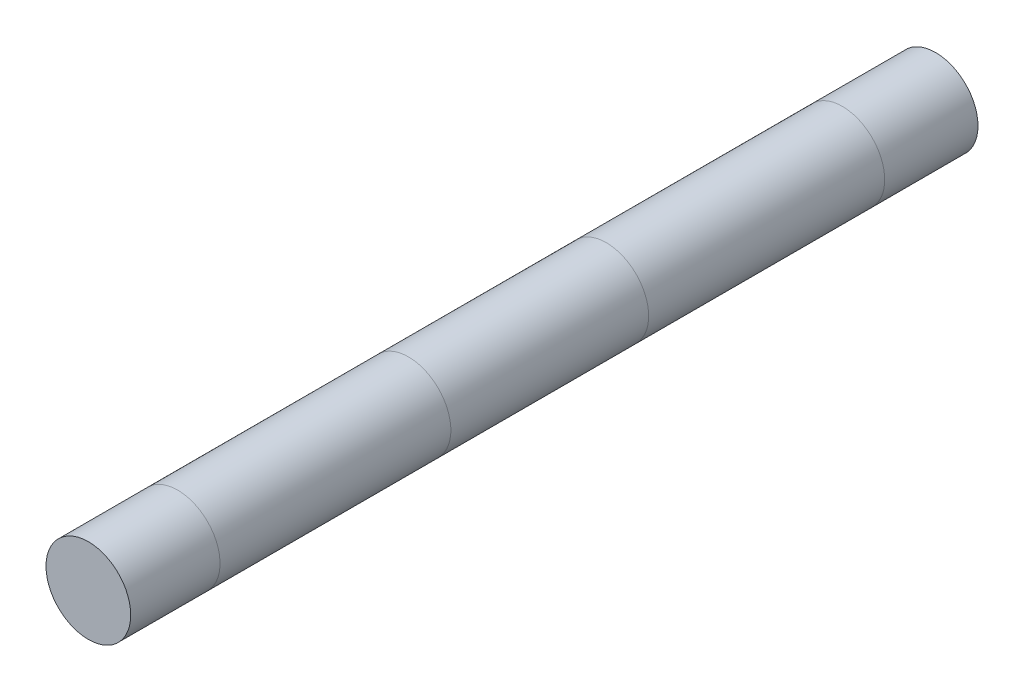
from build123d import *

# Parameters (mm, degrees)
SKETCH1_R           = 12.7
BOSS_EXTRUDE1_DEPTH = 254


with BuildPart() as part:
    # Sketch1 → Boss-Extrude1 (new body)
    with BuildSketch(Plane.XY):
        Circle(SKETCH1_R)
    extrude(amount=BOSS_EXTRUDE1_DEPTH)


solid = part.part
